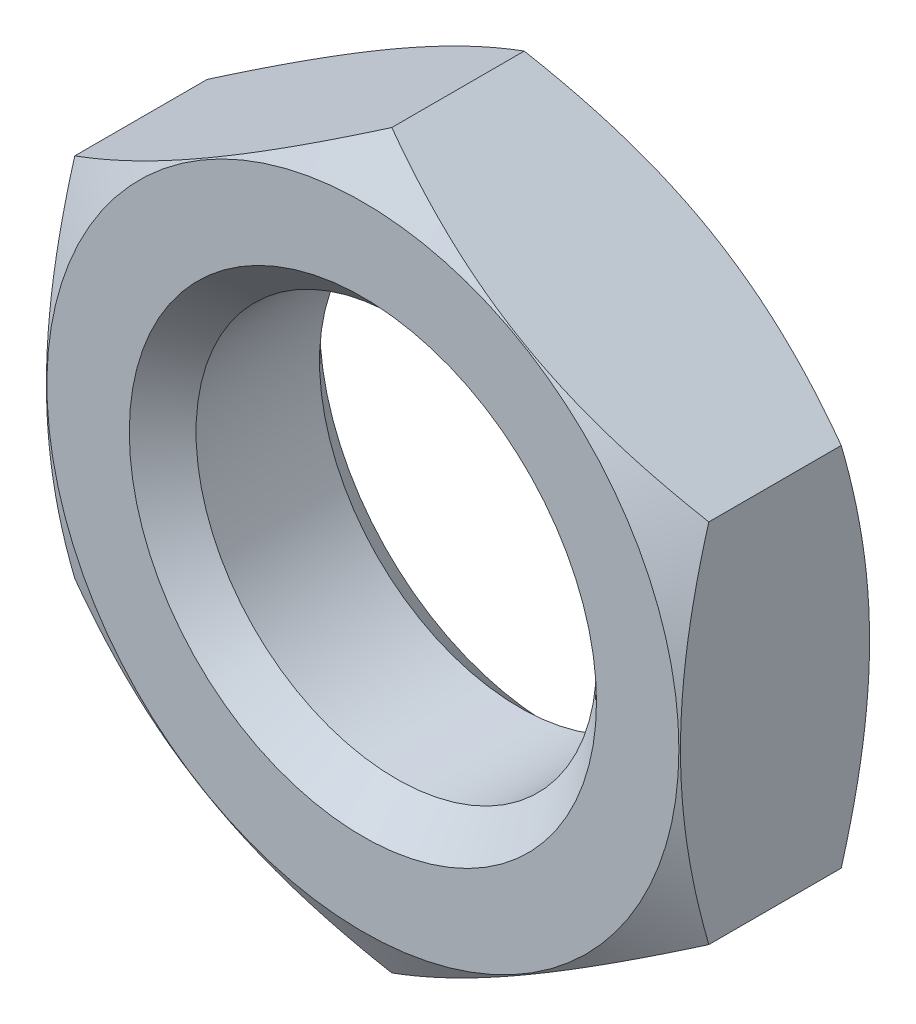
from build123d import *

# Parameters (mm, degrees)
BOSS_EXTRUDE1_DEPTH = 2.85
SKETCH6_R           = 6
CUT_EXTRUDE1_DEPTH  = 5.7
CHAMFER1_SIZE       = 1


with BuildPart() as part:
    # Sketch3 → Boss-Extrude1 (new, symmetric)
    with BuildSketch(Plane.XY):
        Polygon((0, 10.969655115), (-9.5, 5.484827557), (-9.5, -5.484827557), (0, -10.969655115), (9.5, -5.484827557), (9.5, 5.484827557), align=None)
    extrude(amount=BOSS_EXTRUDE1_DEPTH, both=True)

    # Sketch5 → Cut-Revolve1 (revolve, cut)
    with BuildSketch(Plane(origin=(0, 0, 0), x_dir=(0, 0, -1), z_dir=(1, 0, 0)), mode=Mode.PRIVATE) as cut_revolve1_sk:
        Polygon((-2.85, 10.969655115), (-2.85, 9.469655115), (-1.983974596, 10.969655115), align=None)
    cut_revolve1 = revolve(cut_revolve1_sk.sketch.rotate(Axis((0, 0, 5.457798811), (0, 0, -1)), 300.000000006), axis=Axis((0, 0, 5.457798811), (0, 0, -1)), mode=Mode.SUBTRACT)

    # Mirror1: Cut-Revolve1 across plane
    add(cut_revolve1.mirror(Plane.XY), mode=Mode.SUBTRACT)

    # Sketch6 → Cut-Extrude1 (cut)
    with BuildSketch(Plane.XY.offset(2.85)):
        Circle(SKETCH6_R)
    extrude(amount=-CUT_EXTRUDE1_DEPTH, mode=Mode.SUBTRACT)

    # Chamfer1
    chamfer1_edges = [part.edges().sort_by_distance(p)[0] for p in [
        (-6, 0, -2.85),
        (-6, 0, 2.85),
    ]]
    chamfer(chamfer1_edges, length=CHAMFER1_SIZE)


solid = part.part
